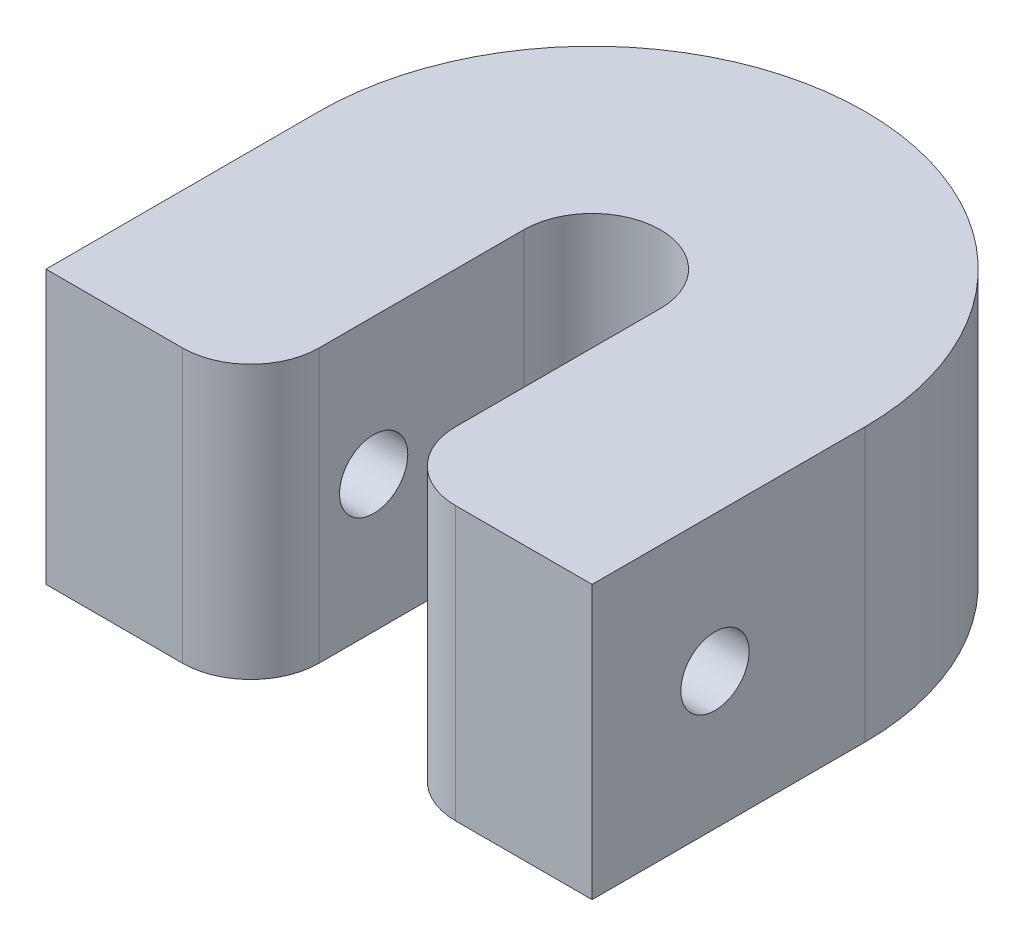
ISO-10303-21;
HEADER;
FILE_DESCRIPTION(('STEP AP214'),'2;1');
FILE_NAME('part.step','',(''),(''),'','','');
FILE_SCHEMA(('AUTOMOTIVE_DESIGN { 1 0 10303 214 1 1 1 1 }'));
ENDSEC;
DATA;
#1=APPLICATION_CONTEXT('core data for automotive mechanical design processes');
#2=APPLICATION_PROTOCOL_DEFINITION('international standard','automotive_design',2000,#1);
#3=PRODUCT_CONTEXT('',#1,'mechanical');
#4=PRODUCT('Part','Part','',(#3));
#5=PRODUCT_RELATED_PRODUCT_CATEGORY('part','',(#4));
#6=PRODUCT_DEFINITION_FORMATION('','',#4);
#7=PRODUCT_DEFINITION_CONTEXT('part definition',#1,'design');
#8=PRODUCT_DEFINITION('design','',#6,#7);
#9=PRODUCT_DEFINITION_SHAPE('','',#8);
#10=(LENGTH_UNIT() NAMED_UNIT(*) SI_UNIT(.MILLI.,.METRE.));
#11=(NAMED_UNIT(*) PLANE_ANGLE_UNIT() SI_UNIT($,.RADIAN.));
#12=(NAMED_UNIT(*) SI_UNIT($,.STERADIAN.) SOLID_ANGLE_UNIT());
#13=UNCERTAINTY_MEASURE_WITH_UNIT(LENGTH_MEASURE(1.E-05),#10,'distance_accuracy_value','');
#14=(GEOMETRIC_REPRESENTATION_CONTEXT(3) GLOBAL_UNCERTAINTY_ASSIGNED_CONTEXT((#13)) GLOBAL_UNIT_ASSIGNED_CONTEXT((#10,
#11,#12)) REPRESENTATION_CONTEXT('',''));
#15=CARTESIAN_POINT('',(0.,0.,0.));
#16=DIRECTION('',(0.,0.,1.));
#17=DIRECTION('',(1.,0.,0.));
#18=AXIS2_PLACEMENT_3D('',#15,#16,#17);
#19=CARTESIAN_POINT('',(0.,25.4,-230.886));
#20=DIRECTION('',(0.,-1.,0.));
#21=DIRECTION('',(0.,0.,-1.));
#22=AXIS2_PLACEMENT_3D('',#19,#20,#21);
#23=CYLINDRICAL_SURFACE('',#22,6.34999999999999);
#24=CARTESIAN_POINT('',(0.,0.,-230.886));
#25=DIRECTION('',(0.,1.,0.));
#26=DIRECTION('',(0.,0.,1.));
#27=AXIS2_PLACEMENT_3D('',#24,#25,#26);
#28=CIRCLE('',#27,6.34999999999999);
#29=CARTESIAN_POINT('',(6.34999999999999,0.,-230.886));
#30=VERTEX_POINT('',#29);
#31=CARTESIAN_POINT('',(-6.34999999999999,0.,-230.886));
#32=VERTEX_POINT('',#31);
#33=EDGE_CURVE('E127',#30,#32,#28,.T.);
#34=ORIENTED_EDGE('',*,*,#33,.F.);
#35=DIRECTION('',(0.,-1.,0.));
#36=VECTOR('',#35,1.);
#37=CARTESIAN_POINT('',(6.34999999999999,25.4,-230.886));
#38=LINE('',#37,#36);
#39=CARTESIAN_POINT('',(6.34999999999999,25.4,-230.886));
#40=VERTEX_POINT('',#39);
#41=EDGE_CURVE('E122',#40,#30,#38,.T.);
#42=ORIENTED_EDGE('',*,*,#41,.F.);
#43=CARTESIAN_POINT('',(0.,25.4,-230.886));
#44=DIRECTION('',(0.,1.,0.));
#45=DIRECTION('',(0.,0.,1.));
#46=AXIS2_PLACEMENT_3D('',#43,#44,#45);
#47=CIRCLE('',#46,6.34999999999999);
#48=CARTESIAN_POINT('',(-6.34999999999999,25.4,-230.886));
#49=VERTEX_POINT('',#48);
#50=EDGE_CURVE('E124',#40,#49,#47,.T.);
#51=ORIENTED_EDGE('',*,*,#50,.T.);
#52=DIRECTION('',(0.,-1.,0.));
#53=VECTOR('',#52,1.);
#54=CARTESIAN_POINT('',(-6.34999999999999,25.4,-230.886));
#55=LINE('',#54,#53);
#56=EDGE_CURVE('E171',#49,#32,#55,.T.);
#57=ORIENTED_EDGE('',*,*,#56,.T.);
#58=EDGE_LOOP('',(#34,#42,#51,#57));
#59=FACE_BOUND('',#58,.T.);
#60=ADVANCED_FACE('F43',(#59),#23,.F.);
#61=CARTESIAN_POINT('',(6.34999999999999,25.4,0.));
#62=DIRECTION('',(1.,0.,0.));
#63=DIRECTION('',(0.,0.,-1.));
#64=AXIS2_PLACEMENT_3D('',#61,#62,#63);
#65=PLANE('',#64);
#66=CARTESIAN_POINT('',(6.34999999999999,12.7,-216.916));
#67=DIRECTION('',(1.,0.,0.));
#68=DIRECTION('',(0.,0.,-1.));
#69=AXIS2_PLACEMENT_3D('',#66,#67,#68);
#70=CIRCLE('',#69,3.175);
#71=CARTESIAN_POINT('',(6.34999999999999,12.7,-220.091));
#72=VERTEX_POINT('',#71);
#73=EDGE_CURVE('E151',#72,#72,#70,.T.);
#74=ORIENTED_EDGE('',*,*,#73,.T.);
#75=EDGE_LOOP('',(#74));
#76=FACE_BOUND('',#75,.T.);
#77=DIRECTION('',(0.,0.,1.));
#78=VECTOR('',#77,1.);
#79=CARTESIAN_POINT('',(6.34999999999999,0.,0.));
#80=LINE('',#79,#78);
#81=CARTESIAN_POINT('',(6.34999999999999,0.,-211.836));
#82=VERTEX_POINT('',#81);
#83=EDGE_CURVE('E174',#30,#82,#80,.T.);
#84=ORIENTED_EDGE('',*,*,#83,.T.);
#85=DIRECTION('',(0.,-1.,0.));
#86=VECTOR('',#85,1.);
#87=CARTESIAN_POINT('',(6.34999999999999,25.4,-211.836));
#88=LINE('',#87,#86);
#89=CARTESIAN_POINT('',(6.34999999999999,25.4,-211.836));
#90=VERTEX_POINT('',#89);
#91=EDGE_CURVE('E11',#82,#90,#88,.F.);
#92=ORIENTED_EDGE('',*,*,#91,.T.);
#93=DIRECTION('',(0.,0.,1.));
#94=VECTOR('',#93,1.);
#95=CARTESIAN_POINT('',(6.34999999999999,25.4,0.));
#96=LINE('',#95,#94);
#97=EDGE_CURVE('E133',#40,#90,#96,.T.);
#98=ORIENTED_EDGE('',*,*,#97,.F.);
#99=ORIENTED_EDGE('',*,*,#41,.T.);
#100=EDGE_LOOP('',(#84,#92,#98,#99));
#101=FACE_BOUND('',#100,.T.);
#102=ADVANCED_FACE('F134',(#76,#101),#65,.F.);
#103=CARTESIAN_POINT('',(0.,25.4,-205.486));
#104=DIRECTION('',(0.,0.,1.));
#105=DIRECTION('',(1.,0.,0.));
#106=AXIS2_PLACEMENT_3D('',#103,#104,#105);
#107=PLANE('',#106);
#108=DIRECTION('',(-1.,0.,0.));
#109=VECTOR('',#108,1.);
#110=CARTESIAN_POINT('',(0.,25.4,-205.486));
#111=LINE('',#110,#109);
#112=CARTESIAN_POINT('',(25.4,25.4,-205.486));
#113=VERTEX_POINT('',#112);
#114=CARTESIAN_POINT('',(12.7,25.4,-205.486));
#115=VERTEX_POINT('',#114);
#116=EDGE_CURVE('E136',#113,#115,#111,.T.);
#117=ORIENTED_EDGE('',*,*,#116,.T.);
#118=DIRECTION('',(0.,-1.,0.));
#119=VECTOR('',#118,1.);
#120=CARTESIAN_POINT('',(12.7,0.,-205.486));
#121=LINE('',#120,#119);
#122=CARTESIAN_POINT('',(12.7,0.,-205.486));
#123=VERTEX_POINT('',#122);
#124=EDGE_CURVE('E52',#115,#123,#121,.T.);
#125=ORIENTED_EDGE('',*,*,#124,.T.);
#126=DIRECTION('',(-1.,0.,0.));
#127=VECTOR('',#126,1.);
#128=CARTESIAN_POINT('',(0.,0.,-205.486));
#129=LINE('',#128,#127);
#130=CARTESIAN_POINT('',(25.4,0.,-205.486));
#131=VERTEX_POINT('',#130);
#132=EDGE_CURVE('E177',#131,#123,#129,.T.);
#133=ORIENTED_EDGE('',*,*,#132,.F.);
#134=DIRECTION('',(0.,-1.,0.));
#135=VECTOR('',#134,1.);
#136=CARTESIAN_POINT('',(25.4,25.4,-205.486));
#137=LINE('',#136,#135);
#138=EDGE_CURVE('E131',#113,#131,#137,.T.);
#139=ORIENTED_EDGE('',*,*,#138,.F.);
#140=EDGE_LOOP('',(#117,#125,#133,#139));
#141=FACE_BOUND('',#140,.T.);
#142=ADVANCED_FACE('F237',(#141),#107,.T.);
#143=CARTESIAN_POINT('',(25.4,25.4,0.));
#144=DIRECTION('',(-1.,0.,0.));
#145=DIRECTION('',(0.,0.,1.));
#146=AXIS2_PLACEMENT_3D('',#143,#144,#145);
#147=PLANE('',#146);
#148=CARTESIAN_POINT('',(25.4,12.7,-216.916));
#149=DIRECTION('',(1.,0.,0.));
#150=DIRECTION('',(0.,0.,-1.));
#151=AXIS2_PLACEMENT_3D('',#148,#149,#150);
#152=CIRCLE('',#151,3.175);
#153=CARTESIAN_POINT('',(25.4,12.7,-220.091));
#154=VERTEX_POINT('',#153);
#155=EDGE_CURVE('E214',#154,#154,#152,.T.);
#156=ORIENTED_EDGE('',*,*,#155,.F.);
#157=EDGE_LOOP('',(#156));
#158=FACE_BOUND('',#157,.T.);
#159=DIRECTION('',(0.,0.,-1.));
#160=VECTOR('',#159,1.);
#161=CARTESIAN_POINT('',(25.4,0.,0.));
#162=LINE('',#161,#160);
#163=CARTESIAN_POINT('',(25.4,0.,-230.886));
#164=VERTEX_POINT('',#163);
#165=EDGE_CURVE('E181',#131,#164,#162,.T.);
#166=ORIENTED_EDGE('',*,*,#165,.T.);
#167=DIRECTION('',(0.,-1.,0.));
#168=VECTOR('',#167,1.);
#169=CARTESIAN_POINT('',(25.4,25.4,-230.886));
#170=LINE('',#169,#168);
#171=CARTESIAN_POINT('',(25.4,25.4,-230.886));
#172=VERTEX_POINT('',#171);
#173=EDGE_CURVE('E203',#172,#164,#170,.T.);
#174=ORIENTED_EDGE('',*,*,#173,.F.);
#175=DIRECTION('',(0.,0.,-1.));
#176=VECTOR('',#175,1.);
#177=CARTESIAN_POINT('',(25.4,25.4,0.));
#178=LINE('',#177,#176);
#179=EDGE_CURVE('E156',#113,#172,#178,.T.);
#180=ORIENTED_EDGE('',*,*,#179,.F.);
#181=ORIENTED_EDGE('',*,*,#138,.T.);
#182=EDGE_LOOP('',(#166,#174,#180,#181));
#183=FACE_BOUND('',#182,.T.);
#184=ADVANCED_FACE('F245',(#158,#183),#147,.F.);
#185=CARTESIAN_POINT('',(0.,25.4,-230.886));
#186=DIRECTION('',(0.,-1.,0.));
#187=DIRECTION('',(0.,0.,-1.));
#188=AXIS2_PLACEMENT_3D('',#185,#186,#187);
#189=CYLINDRICAL_SURFACE('',#188,25.4);
#190=CARTESIAN_POINT('',(0.,0.,-230.886));
#191=DIRECTION('',(0.,1.,0.));
#192=DIRECTION('',(0.,0.,1.));
#193=AXIS2_PLACEMENT_3D('',#190,#191,#192);
#194=CIRCLE('',#193,25.4);
#195=CARTESIAN_POINT('',(-25.4,0.,-230.886));
#196=VERTEX_POINT('',#195);
#197=EDGE_CURVE('E184',#164,#196,#194,.T.);
#198=ORIENTED_EDGE('',*,*,#197,.T.);
#199=DIRECTION('',(0.,-1.,0.));
#200=VECTOR('',#199,1.);
#201=CARTESIAN_POINT('',(-25.4,25.4,-230.886));
#202=LINE('',#201,#200);
#203=CARTESIAN_POINT('',(-25.4,25.4,-230.886));
#204=VERTEX_POINT('',#203);
#205=EDGE_CURVE('E200',#204,#196,#202,.T.);
#206=ORIENTED_EDGE('',*,*,#205,.F.);
#207=CARTESIAN_POINT('',(0.,25.4,-230.886));
#208=DIRECTION('',(0.,1.,0.));
#209=DIRECTION('',(0.,0.,1.));
#210=AXIS2_PLACEMENT_3D('',#207,#208,#209);
#211=CIRCLE('',#210,25.4);
#212=EDGE_CURVE('E159',#172,#204,#211,.T.);
#213=ORIENTED_EDGE('',*,*,#212,.F.);
#214=ORIENTED_EDGE('',*,*,#173,.T.);
#215=EDGE_LOOP('',(#198,#206,#213,#214));
#216=FACE_BOUND('',#215,.T.);
#217=ADVANCED_FACE('F249',(#216),#189,.T.);
#218=CARTESIAN_POINT('',(-25.4,25.4,0.));
#219=DIRECTION('',(-1.,0.,0.));
#220=DIRECTION('',(0.,0.,1.));
#221=AXIS2_PLACEMENT_3D('',#218,#219,#220);
#222=PLANE('',#221);
#223=CARTESIAN_POINT('',(-25.4,12.7,-216.916));
#224=DIRECTION('',(-1.,0.,0.));
#225=DIRECTION('',(0.,0.,1.));
#226=AXIS2_PLACEMENT_3D('',#223,#224,#225);
#227=CIRCLE('',#226,3.175);
#228=CARTESIAN_POINT('',(-25.4,12.7,-213.741));
#229=VERTEX_POINT('',#228);
#230=EDGE_CURVE('E213',#229,#229,#227,.T.);
#231=ORIENTED_EDGE('',*,*,#230,.F.);
#232=EDGE_LOOP('',(#231));
#233=FACE_BOUND('',#232,.T.);
#234=DIRECTION('',(0.,0.,-1.));
#235=VECTOR('',#234,1.);
#236=CARTESIAN_POINT('',(-25.4,0.,0.));
#237=LINE('',#236,#235);
#238=CARTESIAN_POINT('',(-25.4,0.,-205.486));
#239=VERTEX_POINT('',#238);
#240=EDGE_CURVE('E188',#239,#196,#237,.T.);
#241=ORIENTED_EDGE('',*,*,#240,.F.);
#242=DIRECTION('',(0.,-1.,0.));
#243=VECTOR('',#242,1.);
#244=CARTESIAN_POINT('',(-25.4,25.4,-205.486));
#245=LINE('',#244,#243);
#246=CARTESIAN_POINT('',(-25.4,25.4,-205.486));
#247=VERTEX_POINT('',#246);
#248=EDGE_CURVE('E197',#247,#239,#245,.T.);
#249=ORIENTED_EDGE('',*,*,#248,.F.);
#250=DIRECTION('',(0.,0.,-1.));
#251=VECTOR('',#250,1.);
#252=CARTESIAN_POINT('',(-25.4,25.4,0.));
#253=LINE('',#252,#251);
#254=EDGE_CURVE('E162',#247,#204,#253,.T.);
#255=ORIENTED_EDGE('',*,*,#254,.T.);
#256=ORIENTED_EDGE('',*,*,#205,.T.);
#257=EDGE_LOOP('',(#241,#249,#255,#256));
#258=FACE_BOUND('',#257,.T.);
#259=ADVANCED_FACE('F256',(#233,#258),#222,.T.);
#260=CARTESIAN_POINT('',(0.,25.4,-205.486));
#261=DIRECTION('',(0.,0.,-1.));
#262=DIRECTION('',(-1.,0.,0.));
#263=AXIS2_PLACEMENT_3D('',#260,#261,#262);
#264=PLANE('',#263);
#265=DIRECTION('',(1.,0.,0.));
#266=VECTOR('',#265,1.);
#267=CARTESIAN_POINT('',(0.,0.,-205.486));
#268=LINE('',#267,#266);
#269=CARTESIAN_POINT('',(-12.7,0.,-205.486));
#270=VERTEX_POINT('',#269);
#271=EDGE_CURVE('E148',#239,#270,#268,.T.);
#272=ORIENTED_EDGE('',*,*,#271,.T.);
#273=DIRECTION('',(0.,-1.,0.));
#274=VECTOR('',#273,1.);
#275=CARTESIAN_POINT('',(-12.7,25.4,-205.486));
#276=LINE('',#275,#274);
#277=CARTESIAN_POINT('',(-12.7,25.4,-205.486));
#278=VERTEX_POINT('',#277);
#279=EDGE_CURVE('E224',#270,#278,#276,.F.);
#280=ORIENTED_EDGE('',*,*,#279,.T.);
#281=DIRECTION('',(1.,0.,0.));
#282=VECTOR('',#281,1.);
#283=CARTESIAN_POINT('',(0.,25.4,-205.486));
#284=LINE('',#283,#282);
#285=EDGE_CURVE('E166',#247,#278,#284,.T.);
#286=ORIENTED_EDGE('',*,*,#285,.F.);
#287=ORIENTED_EDGE('',*,*,#248,.T.);
#288=EDGE_LOOP('',(#272,#280,#286,#287));
#289=FACE_BOUND('',#288,.T.);
#290=ADVANCED_FACE('F259',(#289),#264,.F.);
#291=CARTESIAN_POINT('',(-6.34999999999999,25.4,0.));
#292=DIRECTION('',(1.,0.,0.));
#293=DIRECTION('',(0.,0.,-1.));
#294=AXIS2_PLACEMENT_3D('',#291,#292,#293);
#295=PLANE('',#294);
#296=CARTESIAN_POINT('',(-6.34999999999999,12.7,-216.916));
#297=DIRECTION('',(1.,0.,0.));
#298=DIRECTION('',(0.,0.,-1.));
#299=AXIS2_PLACEMENT_3D('',#296,#297,#298);
#300=CIRCLE('',#299,3.175);
#301=CARTESIAN_POINT('',(-6.34999999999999,12.7,-220.091));
#302=VERTEX_POINT('',#301);
#303=EDGE_CURVE('E209',#302,#302,#300,.T.);
#304=ORIENTED_EDGE('',*,*,#303,.F.);
#305=EDGE_LOOP('',(#304));
#306=FACE_BOUND('',#305,.T.);
#307=DIRECTION('',(0.,0.,1.));
#308=VECTOR('',#307,1.);
#309=CARTESIAN_POINT('',(-6.34999999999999,25.4,0.));
#310=LINE('',#309,#308);
#311=CARTESIAN_POINT('',(-6.34999999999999,25.4,-211.836));
#312=VERTEX_POINT('',#311);
#313=EDGE_CURVE('E141',#49,#312,#310,.T.);
#314=ORIENTED_EDGE('',*,*,#313,.T.);
#315=DIRECTION('',(0.,-1.,0.));
#316=VECTOR('',#315,1.);
#317=CARTESIAN_POINT('',(-6.34999999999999,0.,-211.836));
#318=LINE('',#317,#316);
#319=CARTESIAN_POINT('',(-6.34999999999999,0.,-211.836));
#320=VERTEX_POINT('',#319);
#321=EDGE_CURVE('E130',#312,#320,#318,.T.);
#322=ORIENTED_EDGE('',*,*,#321,.T.);
#323=DIRECTION('',(0.,0.,1.));
#324=VECTOR('',#323,1.);
#325=CARTESIAN_POINT('',(-6.34999999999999,0.,0.));
#326=LINE('',#325,#324);
#327=EDGE_CURVE('E143',#32,#320,#326,.T.);
#328=ORIENTED_EDGE('',*,*,#327,.F.);
#329=ORIENTED_EDGE('',*,*,#56,.F.);
#330=EDGE_LOOP('',(#314,#322,#328,#329));
#331=FACE_BOUND('',#330,.T.);
#332=ADVANCED_FACE('F265',(#306,#331),#295,.T.);
#333=CARTESIAN_POINT('',(0.,25.4,0.));
#334=DIRECTION('',(0.,1.,0.));
#335=DIRECTION('',(0.,0.,1.));
#336=AXIS2_PLACEMENT_3D('',#333,#334,#335);
#337=PLANE('',#336);
#338=ORIENTED_EDGE('',*,*,#285,.T.);
#339=CARTESIAN_POINT('',(-12.7,25.4,-211.836));
#340=DIRECTION('',(0.,1.,0.));
#341=DIRECTION('',(0.,0.,1.));
#342=AXIS2_PLACEMENT_3D('',#339,#340,#341);
#343=CIRCLE('',#342,6.35);
#344=EDGE_CURVE('E229',#278,#312,#343,.T.);
#345=ORIENTED_EDGE('',*,*,#344,.T.);
#346=ORIENTED_EDGE('',*,*,#313,.F.);
#347=ORIENTED_EDGE('',*,*,#50,.F.);
#348=ORIENTED_EDGE('',*,*,#97,.T.);
#349=CARTESIAN_POINT('',(12.7,25.4,-211.836));
#350=DIRECTION('',(0.,1.,0.));
#351=DIRECTION('',(0.,0.,1.));
#352=AXIS2_PLACEMENT_3D('',#349,#350,#351);
#353=CIRCLE('',#352,6.35);
#354=EDGE_CURVE('E59',#90,#115,#353,.T.);
#355=ORIENTED_EDGE('',*,*,#354,.T.);
#356=ORIENTED_EDGE('',*,*,#116,.F.);
#357=ORIENTED_EDGE('',*,*,#179,.T.);
#358=ORIENTED_EDGE('',*,*,#212,.T.);
#359=ORIENTED_EDGE('',*,*,#254,.F.);
#360=EDGE_LOOP('',(#338,#345,#346,#347,#348,#355,#356,#357,#358,#359));
#361=FACE_BOUND('',#360,.T.);
#362=ADVANCED_FACE('F139',(#361),#337,.T.);
#363=CARTESIAN_POINT('',(0.,0.,0.));
#364=DIRECTION('',(0.,1.,0.));
#365=DIRECTION('',(0.,0.,1.));
#366=AXIS2_PLACEMENT_3D('',#363,#364,#365);
#367=PLANE('',#366);
#368=ORIENTED_EDGE('',*,*,#327,.T.);
#369=CARTESIAN_POINT('',(-12.7,0.,-211.836));
#370=DIRECTION('',(0.,1.,0.));
#371=DIRECTION('',(0.,0.,1.));
#372=AXIS2_PLACEMENT_3D('',#369,#370,#371);
#373=CIRCLE('',#372,6.35);
#374=EDGE_CURVE('E221',#320,#270,#373,.F.);
#375=ORIENTED_EDGE('',*,*,#374,.T.);
#376=ORIENTED_EDGE('',*,*,#271,.F.);
#377=ORIENTED_EDGE('',*,*,#240,.T.);
#378=ORIENTED_EDGE('',*,*,#197,.F.);
#379=ORIENTED_EDGE('',*,*,#165,.F.);
#380=ORIENTED_EDGE('',*,*,#132,.T.);
#381=CARTESIAN_POINT('',(12.7,0.,-211.836));
#382=DIRECTION('',(0.,1.,0.));
#383=DIRECTION('',(0.,0.,1.));
#384=AXIS2_PLACEMENT_3D('',#381,#382,#383);
#385=CIRCLE('',#384,6.35);
#386=EDGE_CURVE('E218',#123,#82,#385,.F.);
#387=ORIENTED_EDGE('',*,*,#386,.T.);
#388=ORIENTED_EDGE('',*,*,#83,.F.);
#389=ORIENTED_EDGE('',*,*,#33,.T.);
#390=EDGE_LOOP('',(#368,#375,#376,#377,#378,#379,#380,#387,#388,#389));
#391=FACE_BOUND('',#390,.T.);
#392=ADVANCED_FACE('F241',(#391),#367,.F.);
#393=CARTESIAN_POINT('',(-47.498,12.7,-216.916));
#394=DIRECTION('',(1.,0.,0.));
#395=DIRECTION('',(0.,0.,-1.));
#396=AXIS2_PLACEMENT_3D('',#393,#394,#395);
#397=CYLINDRICAL_SURFACE('',#396,3.175);
#398=ORIENTED_EDGE('',*,*,#230,.T.);
#399=EDGE_LOOP('',(#398));
#400=FACE_BOUND('',#399,.T.);
#401=ORIENTED_EDGE('',*,*,#303,.T.);
#402=EDGE_LOOP('',(#401));
#403=FACE_BOUND('',#402,.T.);
#404=ADVANCED_FACE('F297',(#400,#403),#397,.F.);
#405=ORIENTED_EDGE('',*,*,#155,.T.);
#406=EDGE_LOOP('',(#405));
#407=FACE_BOUND('',#406,.T.);
#408=ORIENTED_EDGE('',*,*,#73,.F.);
#409=EDGE_LOOP('',(#408));
#410=FACE_BOUND('',#409,.T.);
#411=ADVANCED_FACE('F271',(#407,#410),#397,.F.);
#412=CARTESIAN_POINT('',(-12.7,25.4,-211.836));
#413=DIRECTION('',(0.,1.,0.));
#414=DIRECTION('',(0.,0.,1.));
#415=AXIS2_PLACEMENT_3D('',#412,#413,#414);
#416=CYLINDRICAL_SURFACE('',#415,6.35);
#417=ORIENTED_EDGE('',*,*,#344,.F.);
#418=ORIENTED_EDGE('',*,*,#279,.F.);
#419=ORIENTED_EDGE('',*,*,#374,.F.);
#420=ORIENTED_EDGE('',*,*,#321,.F.);
#421=EDGE_LOOP('',(#417,#418,#419,#420));
#422=FACE_BOUND('',#421,.T.);
#423=ADVANCED_FACE('F262',(#422),#416,.T.);
#424=CARTESIAN_POINT('',(12.7,25.4,-211.836));
#425=DIRECTION('',(0.,1.,0.));
#426=DIRECTION('',(0.,0.,1.));
#427=AXIS2_PLACEMENT_3D('',#424,#425,#426);
#428=CYLINDRICAL_SURFACE('',#427,6.35);
#429=ORIENTED_EDGE('',*,*,#354,.F.);
#430=ORIENTED_EDGE('',*,*,#91,.F.);
#431=ORIENTED_EDGE('',*,*,#386,.F.);
#432=ORIENTED_EDGE('',*,*,#124,.F.);
#433=EDGE_LOOP('',(#429,#430,#431,#432));
#434=FACE_BOUND('',#433,.T.);
#435=ADVANCED_FACE('F45',(#434),#428,.T.);
#436=CLOSED_SHELL('',(#60,#102,#142,#184,#217,#259,#290,#332,#362,#392,#404,#411,#423,#435));
#437=MANIFOLD_SOLID_BREP('B2',#436);
#438=ADVANCED_BREP_SHAPE_REPRESENTATION('',(#18,#437),#14);
#439=SHAPE_DEFINITION_REPRESENTATION(#9,#438);
ENDSEC;
END-ISO-10303-21;
